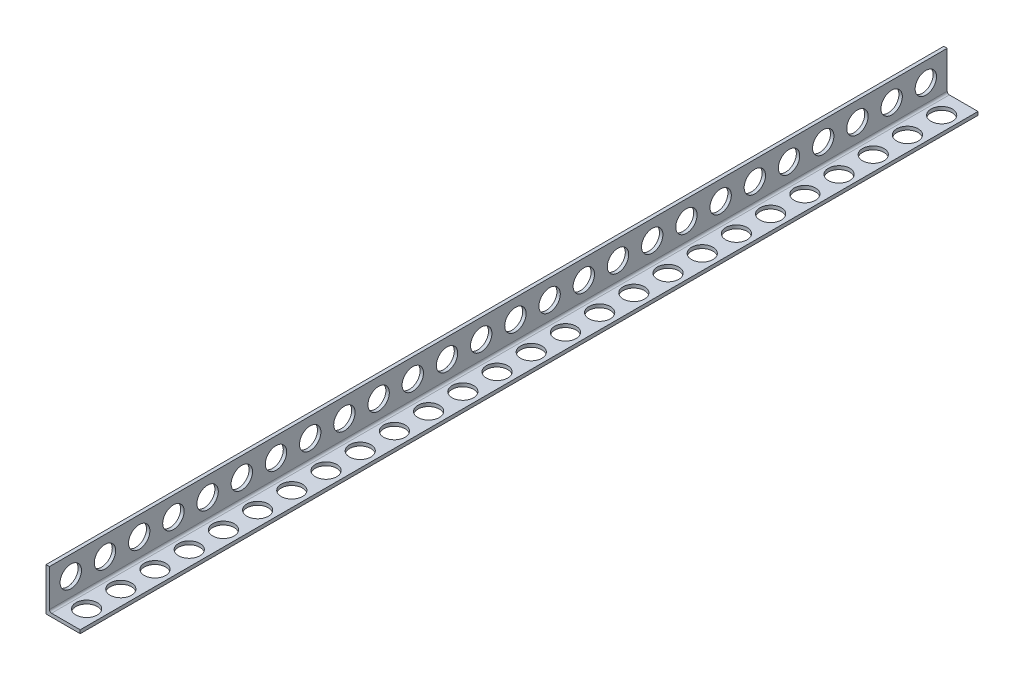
from build123d import *

# Parameters (mm, degrees)
EXTRUDE1_DEPTH     = 2100
FILLET1_R          = 5
SKETCH2_R          = 25
CUT_EXTRUDE1_DEPTH = 2104.901138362
SKETCH3_R          = 25
CUT_EXTRUDE2_DEPTH = 2103.394824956
LPATTERN1_COUNT    = 26
LPATTERN1_PITCH    = 80


with BuildPart() as part:
    # Sketch1 → Extrude1 (new body)
    with BuildSketch(Plane.XY):
        Polygon((-40, 0), (40, 0), (40, 8), (-32, 8), (-32, 100), (-40, 100), align=None)
    extrude(amount=EXTRUDE1_DEPTH)

    # Fillet1
    fillet1_edges = [part.edges().sort_by_distance(p)[0] for p in [
        (-32, 8, 1050),
    ]]
    fillet(fillet1_edges, radius=FILLET1_R)

    # Sketch2 → Cut-Extrude1 (cut, through all)
    with BuildSketch(Plane.ZY.offset(40)):
        with Locations(Location((50, 55, 0), (0, 0, 270))):
            Circle(SKETCH2_R)
    cut_extrude1 = extrude(amount=-CUT_EXTRUDE1_DEPTH, mode=Mode.SUBTRACT)

    # Sketch3 → Cut-Extrude2 (cut, through all)
    with BuildSketch(Plane(origin=(0, 8, 0), x_dir=(-1, 0, 0), z_dir=(0, 1, 0))):
        with Locations(Location((-5, 50, 0), (0, 0, 90))):
            Circle(SKETCH3_R)
    cut_extrude2 = extrude(amount=-CUT_EXTRUDE2_DEPTH, mode=Mode.SUBTRACT)

    # LPattern1: Cut-Extrude1, Cut-Extrude2 ×26
    with Locations(*[(0, 0, i * LPATTERN1_PITCH) for i in range(1, LPATTERN1_COUNT)]):
        add(cut_extrude1, mode=Mode.SUBTRACT)
        add(cut_extrude2, mode=Mode.SUBTRACT)


solid = part.part
